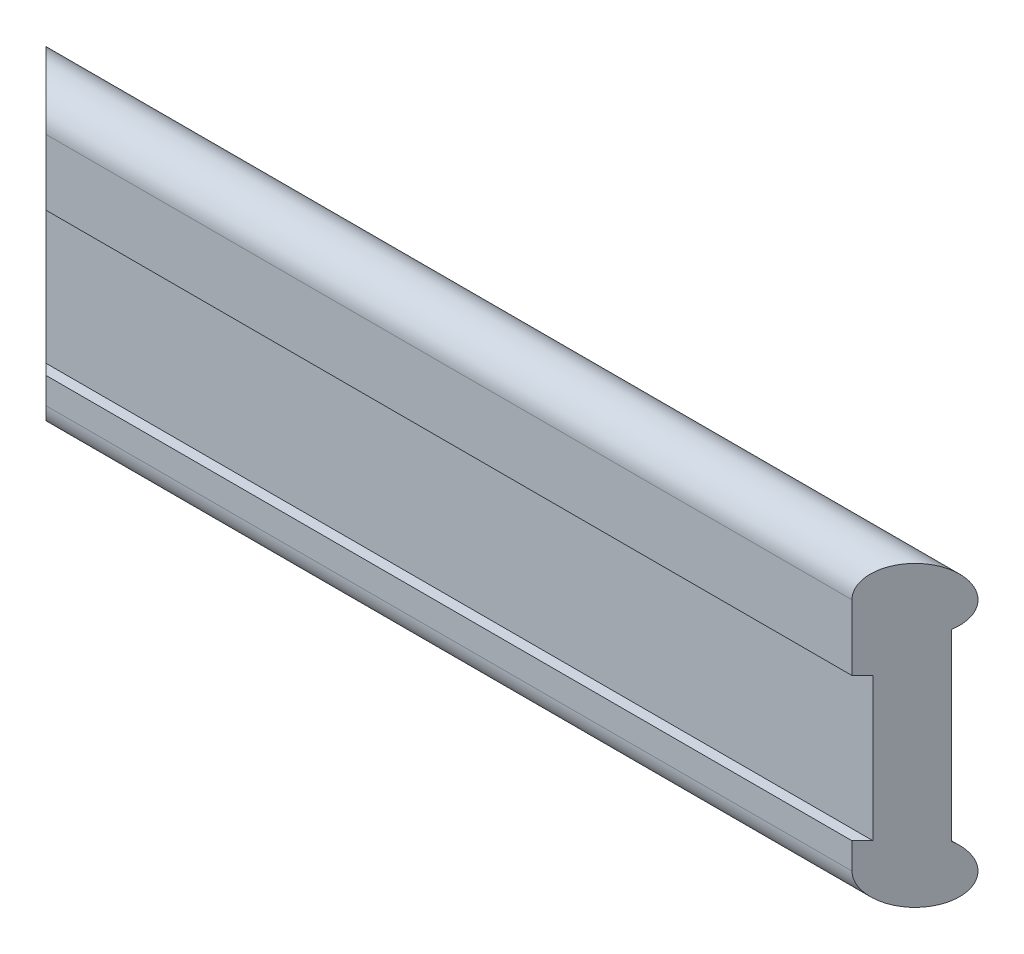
from build123d import *

# Parameters (mm, degrees)
SKETCH1_W               = 355
SKETCH1_H               = 54.5
BOSS_EXTRUDE1_DEPTH     = 15
BOSS_EXTRUDE2_DEPTH     = 355
CUT_EXTRUDE1_DEPTH      = 190.724306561
CUT_EXTRUDE1_DEPTH_BACK = 190.724306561


with BuildPart() as part:
    # Sketch1 → Boss-Extrude1 (new body)
    with BuildSketch(Plane.XY):
        Rectangle(SKETCH1_W, SKETCH1_H)
    extrude(amount=BOSS_EXTRUDE1_DEPTH)

    # Sketch2 → Boss-Extrude2 (add)
    with BuildSketch(Plane.ZY.offset(177.5)):
        with BuildLine():
            Line((15, 27.25), (19, 27.25))
            Line((19, 27.25), (19, 52.25))
            ThreePointArc((19, 52.25), (1.522774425, 62.927078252), (0, 42.503205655))
            Line((0, 42.503205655), (0, 27.25))
            Line((0, 27.25), (15, 27.25))
        make_face()
        with BuildLine():
            Line((0, -27.25), (15, -27.25))
            Line((15, -27.25), (19, -27.25))
            Line((19, -27.25), (19, -37.25))
            ThreePointArc((19, -37.25), (1.522774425, -47.927078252), (0, -27.503205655))
            Line((0, -27.503205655), (0, -27.25))
        make_face()
    extrude(amount=-BOSS_EXTRUDE2_DEPTH)

    # Sketch3 → Cut-Extrude1 (cut, two sides: drawn at the far end of the back side and taken through both)
    with BuildSketch(Plane(origin=(0, 0, 0), x_dir=(1, 0, 0), z_dir=(0, 1, 0)).offset(-CUT_EXTRUDE1_DEPTH_BACK)):
        Polygon((-177.5, 5), (-153.5, -19), (0, -19), (153.5, -19), (177.5, 5), (177.5, -29), (-177.5, -29), align=None)
    extrude(amount=CUT_EXTRUDE1_DEPTH + CUT_EXTRUDE1_DEPTH_BACK, mode=Mode.SUBTRACT)


solid = part.part
